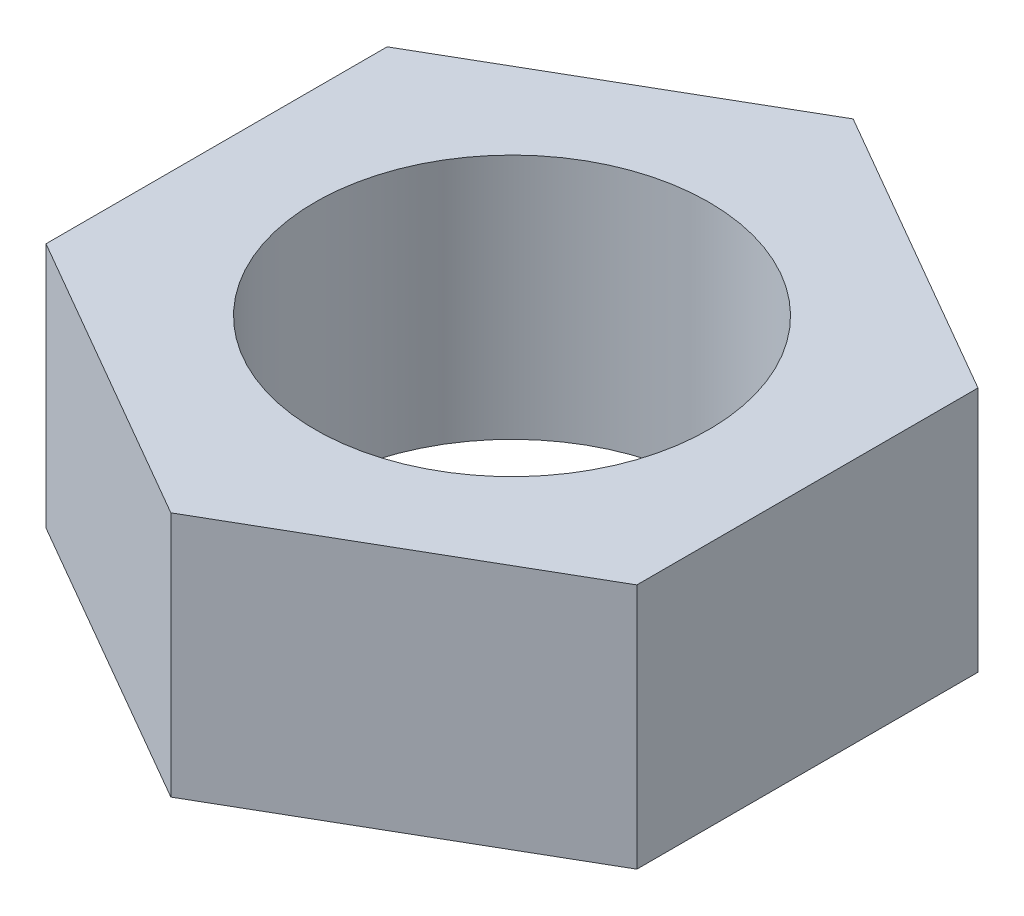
ISO-10303-21;
HEADER;
FILE_DESCRIPTION(('STEP AP214'),'2;1');
FILE_NAME('part.step','',(''),(''),'','','');
FILE_SCHEMA(('AUTOMOTIVE_DESIGN { 1 0 10303 214 1 1 1 1 }'));
ENDSEC;
DATA;
#1=APPLICATION_CONTEXT('core data for automotive mechanical design processes');
#2=APPLICATION_PROTOCOL_DEFINITION('international standard','automotive_design',2000,#1);
#3=PRODUCT_CONTEXT('',#1,'mechanical');
#4=PRODUCT('Part','Part','',(#3));
#5=PRODUCT_RELATED_PRODUCT_CATEGORY('part','',(#4));
#6=PRODUCT_DEFINITION_FORMATION('','',#4);
#7=PRODUCT_DEFINITION_CONTEXT('part definition',#1,'design');
#8=PRODUCT_DEFINITION('design','',#6,#7);
#9=PRODUCT_DEFINITION_SHAPE('','',#8);
#10=(LENGTH_UNIT() NAMED_UNIT(*) SI_UNIT(.MILLI.,.METRE.));
#11=(NAMED_UNIT(*) PLANE_ANGLE_UNIT() SI_UNIT($,.RADIAN.));
#12=(NAMED_UNIT(*) SI_UNIT($,.STERADIAN.) SOLID_ANGLE_UNIT());
#13=UNCERTAINTY_MEASURE_WITH_UNIT(LENGTH_MEASURE(1.E-05),#10,'distance_accuracy_value','');
#14=(GEOMETRIC_REPRESENTATION_CONTEXT(3) GLOBAL_UNCERTAINTY_ASSIGNED_CONTEXT((#13)) GLOBAL_UNIT_ASSIGNED_CONTEXT((#10,
#11,#12)) REPRESENTATION_CONTEXT('',''));
#15=CARTESIAN_POINT('',(0.,0.,0.));
#16=DIRECTION('',(0.,0.,1.));
#17=DIRECTION('',(1.,0.,0.));
#18=AXIS2_PLACEMENT_3D('',#15,#16,#17);
#19=CARTESIAN_POINT('',(9.52499999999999,7.9375,-5.49926131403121));
#20=DIRECTION('',(-0.5,0.,0.866025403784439));
#21=DIRECTION('',(0.866025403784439,0.,0.5));
#22=AXIS2_PLACEMENT_3D('',#19,#20,#21);
#23=PLANE('',#22);
#24=DIRECTION('',(-0.866025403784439,0.,-0.5));
#25=VECTOR('',#24,1.);
#26=CARTESIAN_POINT('',(9.52499999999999,0.,-5.49926131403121));
#27=LINE('',#26,#25);
#28=CARTESIAN_POINT('',(9.52499999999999,0.,-5.49926131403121));
#29=VERTEX_POINT('',#28);
#30=CARTESIAN_POINT('',(0.,0.,-10.9985226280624));
#31=VERTEX_POINT('',#30);
#32=EDGE_CURVE('E90',#29,#31,#27,.T.);
#33=ORIENTED_EDGE('',*,*,#32,.T.);
#34=DIRECTION('',(0.,-1.,0.));
#35=VECTOR('',#34,1.);
#36=CARTESIAN_POINT('',(0.,7.9375,-10.9985226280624));
#37=LINE('',#36,#35);
#38=CARTESIAN_POINT('',(0.,7.9375,-10.9985226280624));
#39=VERTEX_POINT('',#38);
#40=EDGE_CURVE('E11',#39,#31,#37,.T.);
#41=ORIENTED_EDGE('',*,*,#40,.F.);
#42=DIRECTION('',(-0.866025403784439,0.,-0.5));
#43=VECTOR('',#42,1.);
#44=CARTESIAN_POINT('',(9.52499999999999,7.9375,-5.49926131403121));
#45=LINE('',#44,#43);
#46=CARTESIAN_POINT('',(9.52499999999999,7.9375,-5.49926131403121));
#47=VERTEX_POINT('',#46);
#48=EDGE_CURVE('E118',#47,#39,#45,.T.);
#49=ORIENTED_EDGE('',*,*,#48,.F.);
#50=DIRECTION('',(0.,-1.,0.));
#51=VECTOR('',#50,1.);
#52=CARTESIAN_POINT('',(9.52499999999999,7.9375,-5.49926131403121));
#53=LINE('',#52,#51);
#54=EDGE_CURVE('E103',#47,#29,#53,.T.);
#55=ORIENTED_EDGE('',*,*,#54,.T.);
#56=EDGE_LOOP('',(#33,#41,#49,#55));
#57=FACE_BOUND('',#56,.T.);
#58=ADVANCED_FACE('F34',(#57),#23,.F.);
#59=CARTESIAN_POINT('',(0.,7.9375,-10.9985226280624));
#60=DIRECTION('',(0.5,0.,0.866025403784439));
#61=DIRECTION('',(0.866025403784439,0.,-0.5));
#62=AXIS2_PLACEMENT_3D('',#59,#60,#61);
#63=PLANE('',#62);
#64=DIRECTION('',(-0.866025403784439,0.,0.5));
#65=VECTOR('',#64,1.);
#66=CARTESIAN_POINT('',(0.,0.,-10.9985226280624));
#67=LINE('',#66,#65);
#68=CARTESIAN_POINT('',(-9.52500000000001,0.,-5.49926131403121));
#69=VERTEX_POINT('',#68);
#70=EDGE_CURVE('E86',#31,#69,#67,.T.);
#71=ORIENTED_EDGE('',*,*,#70,.T.);
#72=DIRECTION('',(0.,-1.,0.));
#73=VECTOR('',#72,1.);
#74=CARTESIAN_POINT('',(-9.52500000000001,7.9375,-5.49926131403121));
#75=LINE('',#74,#73);
#76=CARTESIAN_POINT('',(-9.52500000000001,7.9375,-5.49926131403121));
#77=VERTEX_POINT('',#76);
#78=EDGE_CURVE('E41',#77,#69,#75,.T.);
#79=ORIENTED_EDGE('',*,*,#78,.F.);
#80=DIRECTION('',(-0.866025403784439,0.,0.5));
#81=VECTOR('',#80,1.);
#82=CARTESIAN_POINT('',(0.,7.9375,-10.9985226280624));
#83=LINE('',#82,#81);
#84=EDGE_CURVE('E99',#39,#77,#83,.T.);
#85=ORIENTED_EDGE('',*,*,#84,.F.);
#86=ORIENTED_EDGE('',*,*,#40,.T.);
#87=EDGE_LOOP('',(#71,#79,#85,#86));
#88=FACE_BOUND('',#87,.T.);
#89=ADVANCED_FACE('F98',(#88),#63,.F.);
#90=CARTESIAN_POINT('',(-9.52500000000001,7.9375,-5.49926131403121));
#91=DIRECTION('',(1.,0.,0.));
#92=DIRECTION('',(0.,0.,-1.));
#93=AXIS2_PLACEMENT_3D('',#90,#91,#92);
#94=PLANE('',#93);
#95=DIRECTION('',(0.,0.,1.));
#96=VECTOR('',#95,1.);
#97=CARTESIAN_POINT('',(-9.52500000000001,0.,-5.49926131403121));
#98=LINE('',#97,#96);
#99=CARTESIAN_POINT('',(-9.52500000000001,0.,5.49926131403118));
#100=VERTEX_POINT('',#99);
#101=EDGE_CURVE('E92',#69,#100,#98,.T.);
#102=ORIENTED_EDGE('',*,*,#101,.T.);
#103=DIRECTION('',(0.,-1.,0.));
#104=VECTOR('',#103,1.);
#105=CARTESIAN_POINT('',(-9.52500000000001,7.9375,5.49926131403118));
#106=LINE('',#105,#104);
#107=CARTESIAN_POINT('',(-9.52500000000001,7.9375,5.49926131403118));
#108=VERTEX_POINT('',#107);
#109=EDGE_CURVE('E134',#108,#100,#106,.T.);
#110=ORIENTED_EDGE('',*,*,#109,.F.);
#111=DIRECTION('',(0.,0.,1.));
#112=VECTOR('',#111,1.);
#113=CARTESIAN_POINT('',(-9.52500000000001,7.9375,-5.49926131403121));
#114=LINE('',#113,#112);
#115=EDGE_CURVE('E121',#77,#108,#114,.T.);
#116=ORIENTED_EDGE('',*,*,#115,.F.);
#117=ORIENTED_EDGE('',*,*,#78,.T.);
#118=EDGE_LOOP('',(#102,#110,#116,#117));
#119=FACE_BOUND('',#118,.T.);
#120=ADVANCED_FACE('F138',(#119),#94,.F.);
#121=CARTESIAN_POINT('',(-9.52500000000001,7.9375,5.49926131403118));
#122=DIRECTION('',(0.5,0.,-0.866025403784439));
#123=DIRECTION('',(-0.866025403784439,0.,-0.5));
#124=AXIS2_PLACEMENT_3D('',#121,#122,#123);
#125=PLANE('',#124);
#126=DIRECTION('',(0.866025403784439,0.,0.5));
#127=VECTOR('',#126,1.);
#128=CARTESIAN_POINT('',(-9.52500000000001,0.,5.49926131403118));
#129=LINE('',#128,#127);
#130=CARTESIAN_POINT('',(0.,0.,10.9985226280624));
#131=VERTEX_POINT('',#130);
#132=EDGE_CURVE('E112',#100,#131,#129,.T.);
#133=ORIENTED_EDGE('',*,*,#132,.T.);
#134=DIRECTION('',(0.,-1.,0.));
#135=VECTOR('',#134,1.);
#136=CARTESIAN_POINT('',(0.,7.9375,10.9985226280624));
#137=LINE('',#136,#135);
#138=CARTESIAN_POINT('',(0.,7.9375,10.9985226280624));
#139=VERTEX_POINT('',#138);
#140=EDGE_CURVE('E131',#139,#131,#137,.T.);
#141=ORIENTED_EDGE('',*,*,#140,.F.);
#142=DIRECTION('',(0.866025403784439,0.,0.5));
#143=VECTOR('',#142,1.);
#144=CARTESIAN_POINT('',(-9.52500000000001,7.9375,5.49926131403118));
#145=LINE('',#144,#143);
#146=EDGE_CURVE('E123',#108,#139,#145,.T.);
#147=ORIENTED_EDGE('',*,*,#146,.F.);
#148=ORIENTED_EDGE('',*,*,#109,.T.);
#149=EDGE_LOOP('',(#133,#141,#147,#148));
#150=FACE_BOUND('',#149,.T.);
#151=ADVANCED_FACE('F144',(#150),#125,.F.);
#152=CARTESIAN_POINT('',(0.,7.9375,10.9985226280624));
#153=DIRECTION('',(-0.499999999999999,0.,-0.866025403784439));
#154=DIRECTION('',(-0.866025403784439,0.,0.5));
#155=AXIS2_PLACEMENT_3D('',#152,#153,#154);
#156=PLANE('',#155);
#157=DIRECTION('',(0.866025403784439,0.,-0.5));
#158=VECTOR('',#157,1.);
#159=CARTESIAN_POINT('',(0.,0.,10.9985226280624));
#160=LINE('',#159,#158);
#161=CARTESIAN_POINT('',(9.525,0.,5.49926131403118));
#162=VERTEX_POINT('',#161);
#163=EDGE_CURVE('E114',#131,#162,#160,.T.);
#164=ORIENTED_EDGE('',*,*,#163,.T.);
#165=DIRECTION('',(0.,-1.,0.));
#166=VECTOR('',#165,1.);
#167=CARTESIAN_POINT('',(9.525,7.9375,5.49926131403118));
#168=LINE('',#167,#166);
#169=CARTESIAN_POINT('',(9.525,7.9375,5.49926131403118));
#170=VERTEX_POINT('',#169);
#171=EDGE_CURVE('E128',#170,#162,#168,.T.);
#172=ORIENTED_EDGE('',*,*,#171,.F.);
#173=DIRECTION('',(0.866025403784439,0.,-0.5));
#174=VECTOR('',#173,1.);
#175=CARTESIAN_POINT('',(0.,7.9375,10.9985226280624));
#176=LINE('',#175,#174);
#177=EDGE_CURVE('E53',#139,#170,#176,.T.);
#178=ORIENTED_EDGE('',*,*,#177,.F.);
#179=ORIENTED_EDGE('',*,*,#140,.T.);
#180=EDGE_LOOP('',(#164,#172,#178,#179));
#181=FACE_BOUND('',#180,.T.);
#182=ADVANCED_FACE('F147',(#181),#156,.F.);
#183=CARTESIAN_POINT('',(9.525,7.9375,5.49926131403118));
#184=DIRECTION('',(-1.,0.,0.));
#185=DIRECTION('',(0.,0.,1.));
#186=AXIS2_PLACEMENT_3D('',#183,#184,#185);
#187=PLANE('',#186);
#188=DIRECTION('',(0.,0.,-1.));
#189=VECTOR('',#188,1.);
#190=CARTESIAN_POINT('',(9.525,0.,5.49926131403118));
#191=LINE('',#190,#189);
#192=EDGE_CURVE('E116',#162,#29,#191,.T.);
#193=ORIENTED_EDGE('',*,*,#192,.T.);
#194=ORIENTED_EDGE('',*,*,#54,.F.);
#195=DIRECTION('',(0.,0.,-1.));
#196=VECTOR('',#195,1.);
#197=CARTESIAN_POINT('',(9.525,7.9375,5.49926131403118));
#198=LINE('',#197,#196);
#199=EDGE_CURVE('E48',#170,#47,#198,.T.);
#200=ORIENTED_EDGE('',*,*,#199,.F.);
#201=ORIENTED_EDGE('',*,*,#171,.T.);
#202=EDGE_LOOP('',(#193,#194,#200,#201));
#203=FACE_BOUND('',#202,.T.);
#204=ADVANCED_FACE('F149',(#203),#187,.F.);
#205=CARTESIAN_POINT('',(9.52499999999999,7.9375,-5.49926131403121));
#206=DIRECTION('',(0.,-1.,0.));
#207=DIRECTION('',(0.,0.,-1.));
#208=AXIS2_PLACEMENT_3D('',#205,#206,#207);
#209=PLANE('',#208);
#210=CARTESIAN_POINT('',(0.,7.9375,0.));
#211=DIRECTION('',(0.,-1.,0.));
#212=DIRECTION('',(0.,0.,-1.));
#213=AXIS2_PLACEMENT_3D('',#210,#211,#212);
#214=CIRCLE('',#213,6.35);
#215=CARTESIAN_POINT('',(0.,7.9375,-6.35));
#216=VERTEX_POINT('',#215);
#217=EDGE_CURVE('E104',#216,#216,#214,.T.);
#218=ORIENTED_EDGE('',*,*,#217,.T.);
#219=EDGE_LOOP('',(#218));
#220=FACE_BOUND('',#219,.T.);
#221=ORIENTED_EDGE('',*,*,#48,.T.);
#222=ORIENTED_EDGE('',*,*,#84,.T.);
#223=ORIENTED_EDGE('',*,*,#115,.T.);
#224=ORIENTED_EDGE('',*,*,#146,.T.);
#225=ORIENTED_EDGE('',*,*,#177,.T.);
#226=ORIENTED_EDGE('',*,*,#199,.T.);
#227=EDGE_LOOP('',(#221,#222,#223,#224,#225,#226));
#228=FACE_BOUND('',#227,.T.);
#229=ADVANCED_FACE('F141',(#220,#228),#209,.F.);
#230=CARTESIAN_POINT('',(9.52499999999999,0.,-5.49926131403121));
#231=DIRECTION('',(0.,-1.,0.));
#232=DIRECTION('',(0.,0.,-1.));
#233=AXIS2_PLACEMENT_3D('',#230,#231,#232);
#234=PLANE('',#233);
#235=CARTESIAN_POINT('',(0.,0.,0.));
#236=DIRECTION('',(0.,-1.,0.));
#237=DIRECTION('',(0.,0.,-1.));
#238=AXIS2_PLACEMENT_3D('',#235,#236,#237);
#239=CIRCLE('',#238,6.35);
#240=CARTESIAN_POINT('',(0.,0.,-6.35));
#241=VERTEX_POINT('',#240);
#242=EDGE_CURVE('E107',#241,#241,#239,.T.);
#243=ORIENTED_EDGE('',*,*,#242,.F.);
#244=EDGE_LOOP('',(#243));
#245=FACE_BOUND('',#244,.T.);
#246=ORIENTED_EDGE('',*,*,#32,.F.);
#247=ORIENTED_EDGE('',*,*,#192,.F.);
#248=ORIENTED_EDGE('',*,*,#163,.F.);
#249=ORIENTED_EDGE('',*,*,#132,.F.);
#250=ORIENTED_EDGE('',*,*,#101,.F.);
#251=ORIENTED_EDGE('',*,*,#70,.F.);
#252=EDGE_LOOP('',(#246,#247,#248,#249,#250,#251));
#253=FACE_BOUND('',#252,.T.);
#254=ADVANCED_FACE('F87',(#245,#253),#234,.T.);
#255=CARTESIAN_POINT('',(0.,7.9375,0.));
#256=DIRECTION('',(0.,-1.,0.));
#257=DIRECTION('',(0.,0.,-1.));
#258=AXIS2_PLACEMENT_3D('',#255,#256,#257);
#259=CYLINDRICAL_SURFACE('',#258,6.35);
#260=ORIENTED_EDGE('',*,*,#217,.F.);
#261=EDGE_LOOP('',(#260));
#262=FACE_BOUND('',#261,.T.);
#263=ORIENTED_EDGE('',*,*,#242,.T.);
#264=EDGE_LOOP('',(#263));
#265=FACE_BOUND('',#264,.T.);
#266=ADVANCED_FACE('F190',(#262,#265),#259,.F.);
#267=CLOSED_SHELL('',(#58,#89,#120,#151,#182,#204,#229,#254,#266));
#268=MANIFOLD_SOLID_BREP('B2',#267);
#269=ADVANCED_BREP_SHAPE_REPRESENTATION('',(#18,#268),#14);
#270=SHAPE_DEFINITION_REPRESENTATION(#9,#269);
ENDSEC;
END-ISO-10303-21;
